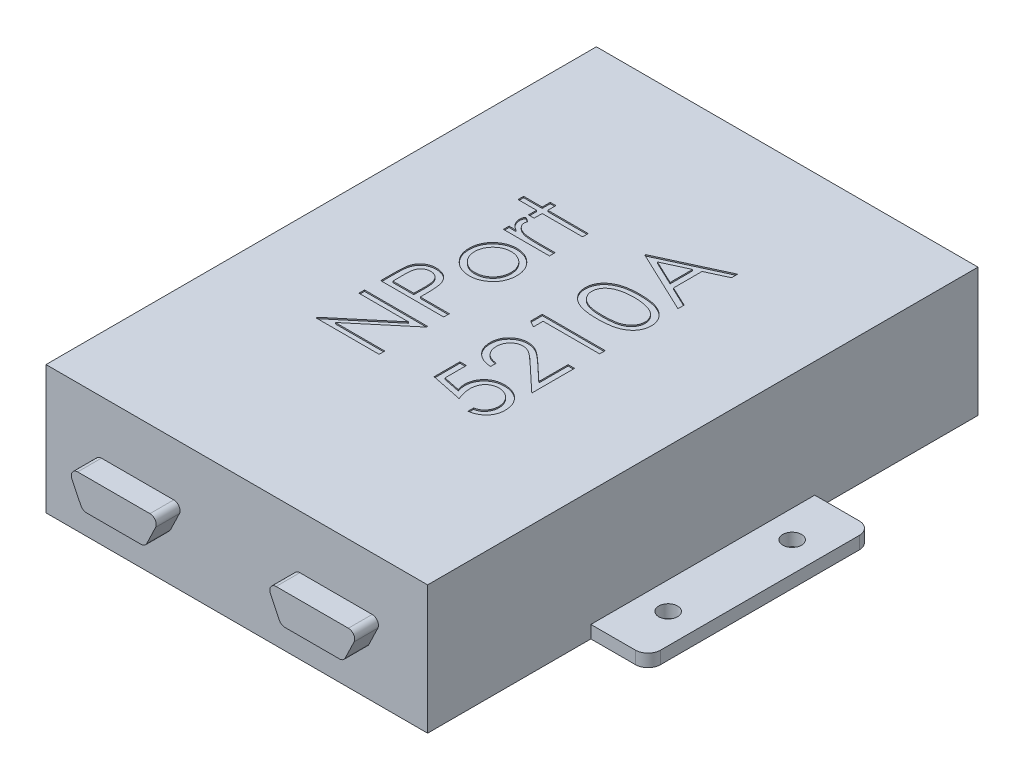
from build123d import *

# Parameters (mm, degrees)
SKETCH1_W           = 76.962
SKETCH1_H           = 110.998
BOSS_EXTRUDE1_DEPTH = 25.908
SKETCH3_R           = 1.893339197
BOSS_EXTRUDE2_DEPTH = 2.54
BOSS_EXTRUDE3_DEPTH = 4.8
SKETCH5_R           = 3.586412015
BOSS_EXTRUDE4_DEPTH = 4.8
SKETCH6_W           = 11.82831006
SKETCH6_H           = 3.119554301
CUT_EXTRUDE1_DEPTH  = 4.8
CUT_EXTRUDE2_DEPTH  = 0.254


with BuildPart() as part:
    # Sketch1 → Boss-Extrude1 (new body)
    with BuildSketch(Plane(origin=(0, 0, 0), x_dir=(1, 0, 0), z_dir=(0, 1, 0))):
        with Locations((38.481, 55.499)):
            Rectangle(SKETCH1_W, SKETCH1_H)
    extrude(amount=BOSS_EXTRUDE1_DEPTH)

    # Sketch3 → Boss-Extrude2 (add)
    # profile 1 of 2: a face of its own
    with BuildSketch(Plane(origin=(0, 0, 0), x_dir=(1, 0, 0), z_dir=(0, 1, 0))):
        with BuildLine():
            Line((0, 78.071386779), (-8.979, 78.071386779))
            ThreePointArc((-8.979, 78.071386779), (-10.775051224, 77.327438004), (-11.519, 75.531386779))
            Line((-11.519, 75.531386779), (-11.519, 35.464613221))
            ThreePointArc((-11.519, 35.464613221), (-10.775051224, 33.668561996), (-8.979, 32.924613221))
            Line((-8.979, 32.924613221), (0, 32.924613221))
            Line((0, 32.924613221), (0, 78.071386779))
        make_face()
        with Locations(Location((-5.519, 67.998, 0), (0, 0, 270))):
            Circle(SKETCH3_R, mode=Mode.SUBTRACT)
        with Locations(Location((-5.519, 42.998, 0), (0, 0, 270))):
            Circle(SKETCH3_R, mode=Mode.SUBTRACT)
    # profile 2 of 2: a face of its own
    with BuildSketch(Plane(origin=(0, 0, 0), x_dir=(1, 0, 0), z_dir=(0, 1, 0))):
        with BuildLine():
            Line((76.962, 78.071386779), (85.941, 78.071386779))
            ThreePointArc((85.941, 78.071386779), (87.737051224, 77.327438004), (88.481, 75.531386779))
            Line((88.481, 75.531386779), (88.481, 35.464613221))
            ThreePointArc((88.481, 35.464613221), (87.737051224, 33.668561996), (85.941, 32.924613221))
            Line((85.941, 32.924613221), (76.962, 32.924613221))
            Line((76.962, 32.924613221), (76.962, 78.071386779))
        make_face()
        with Locations(Location((82.481, 67.998, 0), (0, 0, 270))):
            Circle(SKETCH3_R, mode=Mode.SUBTRACT)
        with Locations(Location((82.481, 42.998, 0), (0, 0, 270))):
            Circle(SKETCH3_R, mode=Mode.SUBTRACT)
    extrude(amount=BOSS_EXTRUDE2_DEPTH)

    # Sketch4 → Boss-Extrude3 (add)
    with BuildSketch(Plane.XY):
        with BuildLine():
            Line((11.178944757, 15.150691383), (25.762179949, 15.150691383))
            ThreePointArc((25.762179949, 15.150691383), (26.837365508, 14.556617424), (26.906661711, 13.330181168))
            Line((26.906661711, 13.330181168), (25.116962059, 9.609489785))
            ThreePointArc((25.116962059, 9.609489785), (24.648406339, 9.084814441), (23.972480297, 8.89))
            Line((23.972480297, 8.89), (12.96864441, 8.89))
            ThreePointArc((12.96864441, 8.89), (12.292718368, 9.084814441), (11.824162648, 9.609489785))
            Line((11.824162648, 9.609489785), (10.034462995, 13.330181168))
            ThreePointArc((10.034462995, 13.330181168), (10.103759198, 14.556617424), (11.178944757, 15.150691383))
        make_face()
        with BuildLine():
            Line((51.199820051, 15.150691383), (65.783055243, 15.150691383))
            ThreePointArc((65.783055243, 15.150691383), (66.858240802, 14.556617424), (66.927537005, 13.330181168))
            Line((66.927537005, 13.330181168), (65.137837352, 9.609489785))
            ThreePointArc((65.137837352, 9.609489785), (64.669281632, 9.084814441), (63.99335559, 8.89))
            Line((63.99335559, 8.89), (52.989519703, 8.89))
            ThreePointArc((52.989519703, 8.89), (52.313593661, 9.084814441), (51.845037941, 9.609489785))
            Line((51.845037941, 9.609489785), (50.055338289, 13.330181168))
            ThreePointArc((50.055338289, 13.330181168), (50.124634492, 14.556617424), (51.199820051, 15.150691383))
        make_face()
    extrude(amount=BOSS_EXTRUDE3_DEPTH)

    # Sketch5 → Boss-Extrude4 (add)
    with BuildSketch(Plane(origin=(0, 0, -110.998), x_dir=(-1, 0, 0), z_dir=(0, 0, -1))):
        with Locations(Location((-11.298504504, 11.677508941, 0), (0, 0, 180))):
            Circle(SKETCH5_R)
    extrude(amount=BOSS_EXTRUDE4_DEPTH)

    # Sketch6 → Cut-Extrude1 (cut)
    with BuildSketch(Plane(origin=(0, 0, -110.998), x_dir=(-1, 0, 0), z_dir=(0, 0, -1))):
        Polygon((-50.319567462, 10.220744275), (-47.514567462, 10.220744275), (-47.514567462, 16.085189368), (-59.194567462, 16.085189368), (-59.194567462, 10.220744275), (-56.389567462, 10.220744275), (-56.389567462, 8.715008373), (-54.979567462, 8.715008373), (-54.979567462, 7.605518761), (-51.729567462, 7.605518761), (-51.729567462, 8.715008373), (-50.319567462, 8.715008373), align=None)
        with Locations((-31.396870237, 12.965635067)):
            Rectangle(SKETCH6_W, SKETCH6_H)
    extrude(amount=-CUT_EXTRUDE1_DEPTH, mode=Mode.SUBTRACT)

    # Sketch2 → Cut-Extrude2 (cut)
    # profile 1 of 10: a face of its own
    with BuildSketch(Plane(origin=(102.87, 25.908, 0), x_dir=(0, 0, -1), z_dir=(0, 1, 0))):
        Polygon((35.380851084, 71.074543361), (35.380851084, 83.774543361), (35.619993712, 83.774543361), (44.010338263, 73.778890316), (44.010338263, 83.774543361), (45.150081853, 83.774543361), (45.150081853, 71.074543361), (44.890586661, 71.074543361), (36.520594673, 81.047299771), (36.520594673, 71.074543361), align=None)
    # profile 2 of 10: a face of its own
    with BuildSketch(Plane(origin=(102.87, 25.908, 0), x_dir=(0, 0, -1), z_dir=(0, 1, 0))):
        with BuildLine():
            Line((48.406492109, 83.774543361), (50.897137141, 83.774543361))
            add(Edge.make_bspline(
                [(50.897137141, 83.774543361), (51.068445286, 83.774355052), (51.3966793, 83.773994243), (51.867359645, 83.763055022), (52.294840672, 83.748443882), (52.678200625, 83.728189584), (53.018619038, 83.704253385), (53.314555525, 83.6706817), (53.568336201, 83.635628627), (53.720396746, 83.599990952), (53.789745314, 83.583738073)],
                knots=[0, 0, 0, 0, 1.415646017, 2.712440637, 3.8905458, 4.950247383, 5.884950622, 6.709939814, 7.411656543, 8, 8, 8, 8], degree=3))
            add(Edge.make_bspline(
                [(53.789745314, 83.583738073), (53.87753328, 83.559709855), (54.051040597, 83.512219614), (54.301052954, 83.417101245), (54.538919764, 83.304317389), (54.765457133, 83.175779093), (54.977881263, 83.025971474), (55.179361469, 82.860967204), (55.368119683, 82.676956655), (55.543094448, 82.476003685), (55.703785, 82.261481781), (55.842141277, 82.030188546), (55.957991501, 81.786017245), (56.057353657, 81.529137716), (56.128867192, 81.257392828), (56.182740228, 80.972670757), (56.216934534, 80.675002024), (56.220209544, 80.471584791), (56.221876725, 80.368032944)],
                knots=[0, 0, 0, 0, 0.999701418, 1.975846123, 2.934577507, 3.890451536, 4.834027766, 5.787354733, 6.749476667, 7.726910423, 8.712836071, 9.690891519, 10.682875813, 11.679750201, 12.712814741, 13.765529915, 14.8625177, 16, 16, 16, 16], degree=3))
            add(Edge.make_bspline(
                [(56.221876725, 80.368032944), (56.220347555, 80.263610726), (56.217355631, 80.059301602), (56.181446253, 79.760406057), (56.1330767, 79.474770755), (56.058701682, 79.203029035), (55.96129024, 78.946794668), (55.847019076, 78.702151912), (55.709193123, 78.473262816), (55.550824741, 78.259296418), (55.374651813, 78.060051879), (55.181419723, 77.876973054), (54.971908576, 77.711131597), (54.74678421, 77.562155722), (54.503851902, 77.433500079), (54.246796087, 77.31826643), (53.973382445, 77.221488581), (53.784179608, 77.170579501), (53.687982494, 77.144695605)],
                knots=[0, 0, 0, 0, 1.121902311, 2.195077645, 3.232258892, 4.234102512, 5.217864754, 6.176164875, 7.132989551, 8.084763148, 9.034132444, 9.988522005, 10.94243251, 11.903244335, 12.886203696, 13.894208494, 14.929344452, 16, 16, 16, 16], degree=3))
            add(Edge.make_bspline(
                [(53.687982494, 77.144695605), (53.608417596, 77.127775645), (53.434046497, 77.090694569), (53.146871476, 77.049298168), (52.812515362, 77.013964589), (52.431434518, 76.987471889), (52.003971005, 76.964791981), (51.529893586, 76.946764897), (51.008271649, 76.936859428), (50.644430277, 76.936348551), (50.454468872, 76.936081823)],
                knots=[0, 0, 0, 0, 0.601384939, 1.31797006, 2.144135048, 3.087295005, 4.142315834, 5.309527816, 6.595305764, 8, 8, 8, 8], degree=3))
            Line((50.454468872, 76.936081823), (49.546235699, 76.936081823))
            Line((49.546235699, 76.936081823), (49.546235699, 71.074543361))
            Line((49.546235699, 71.074543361), (48.406492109, 71.074543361))
            Line((48.406492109, 71.074543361), (48.406492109, 83.774543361))
        make_face()
        with BuildLine():
            Line((49.546235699, 82.471979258), (49.546235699, 78.238645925))
            Line((49.546235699, 78.238645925), (51.769753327, 78.210661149))
            add(Edge.make_bspline(
                [(51.769753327, 78.210661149), (51.878319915, 78.210605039), (52.087905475, 78.210496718), (52.390659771, 78.224957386), (52.671544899, 78.241650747), (52.929698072, 78.266092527), (53.165235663, 78.30064109), (53.378550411, 78.335517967), (53.567988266, 78.385974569), (53.789691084, 78.453912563), (54.036736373, 78.569782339), (54.305495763, 78.737966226), (54.53326332, 78.952344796), (54.730361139, 79.193382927), (54.886773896, 79.461531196), (55.001277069, 79.748438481), (55.068554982, 80.051162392), (55.077576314, 80.258310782), (55.082133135, 80.362944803)],
                knots=[0, 0, 0, 0, 1.160613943, 2.240541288, 3.23993089, 4.169200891, 5.011653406, 5.7853311, 6.478053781, 7.106038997, 8.262395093, 9.384106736, 10.481365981, 11.59014053, 12.70357646, 13.786202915, 14.881775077, 16, 16, 16, 16], degree=3))
            add(Edge.make_bspline(
                [(55.082133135, 80.362944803), (55.077551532, 80.465047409), (55.068443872, 80.668014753), (55.00074974, 80.965480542), (54.886996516, 81.249364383), (54.729311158, 81.514152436), (54.537936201, 81.754323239), (54.315507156, 81.962955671), (54.062547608, 82.130674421), (53.827241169, 82.238926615), (53.618231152, 82.305022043), (53.436686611, 82.351267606), (53.231706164, 82.388190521), (53.003223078, 82.418088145), (52.753008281, 82.443682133), (52.47891211, 82.461048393), (52.18197289, 82.471213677), (51.975831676, 82.471717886), (51.868972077, 82.471979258)],
                knots=[0, 0, 0, 0, 1.120700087, 2.227813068, 3.331159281, 4.466773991, 5.599788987, 6.693661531, 7.80175334, 8.91857717, 9.525282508, 10.207424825, 10.974604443, 11.810962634, 12.737642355, 13.736264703, 14.826523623, 16, 16, 16, 16], degree=3))
            Line((51.868972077, 82.471979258), (49.546235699, 82.471979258))
        make_face(mode=Mode.SUBTRACT)
    # profile 3 of 10: a face of its own
    with BuildSketch(Plane(origin=(102.87, 25.908, 0), x_dir=(0, 0, -1), z_dir=(0, 1, 0))):
        with BuildLine():
            add(Edge.make_bspline(
                [(62.984016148, 80.518133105), (63.158155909, 80.5144251), (63.499601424, 80.507154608), (63.999647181, 80.429448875), (64.476968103, 80.310622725), (64.933392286, 80.146351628), (65.363074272, 79.926162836), (65.772272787, 79.663420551), (66.159865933, 79.352152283), (66.392178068, 79.111367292), (66.510097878, 78.989146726)],
                knots=[0, 0, 0, 0, 1.054011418, 2.066658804, 3.057071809, 4.030435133, 4.997543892, 5.974964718, 6.972108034, 8, 8, 8, 8], degree=3))
            add(Edge.make_bspline(
                [(66.510097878, 78.989146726), (66.611632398, 78.872255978), (66.812736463, 78.640736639), (67.0706035, 78.265340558), (67.292750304, 77.87657505), (67.470778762, 77.469277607), (67.611150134, 77.047003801), (67.710811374, 76.608302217), (67.77009111, 76.1541417), (67.778084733, 75.845699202), (67.782133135, 75.689487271)],
                knots=[0, 0, 0, 0, 1.025258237, 2.030674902, 3.01204498, 3.988269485, 4.97094183, 5.956517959, 6.965070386, 8, 8, 8, 8], degree=3))
            add(Edge.make_bspline(
                [(67.782133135, 75.689487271), (67.778572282, 75.532369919), (67.771535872, 75.221898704), (67.704974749, 74.764628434), (67.601447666, 74.321235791), (67.453286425, 73.893577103), (67.263301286, 73.480345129), (67.031469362, 73.083344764), (66.75616378, 72.701792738), (66.444092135, 72.338928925), (66.099189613, 72.004497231), (65.725025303, 71.713020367), (65.328952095, 71.46329655), (64.905703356, 71.262141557), (64.459144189, 71.103537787), (63.988311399, 70.992140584), (63.49393643, 70.924788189), (63.156380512, 70.916139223), (62.984016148, 70.911722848)],
                knots=[0, 0, 0, 0, 0.998656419, 1.973391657, 2.932242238, 3.890759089, 4.846373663, 5.82037756, 6.809684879, 7.83454468, 8.860553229, 9.859544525, 10.845671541, 11.83227036, 12.833544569, 13.85385346, 14.904124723, 16, 16, 16, 16], degree=3))
            add(Edge.make_bspline(
                [(62.984016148, 70.911722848), (62.810807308, 70.916154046), (62.471569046, 70.92483277), (61.975449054, 70.991878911), (61.503772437, 71.103486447), (61.056628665, 71.262662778), (60.631560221, 71.46330298), (60.233192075, 71.712265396), (59.85872381, 72.004583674), (59.513748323, 72.338905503), (59.201696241, 72.701798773), (58.926385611, 73.083343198), (58.694554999, 73.480345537), (58.504569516, 73.893576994), (58.356408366, 74.321235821), (58.252881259, 74.764628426), (58.186320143, 75.221898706), (58.179283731, 75.53236992), (58.175722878, 75.689487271)],
                knots=[0, 0, 0, 0, 1.099876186, 2.154163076, 3.173186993, 4.173200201, 5.163417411, 6.152872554, 7.150605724, 8.17532212, 9.198891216, 10.186952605, 11.159729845, 12.11414092, 13.071450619, 14.029093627, 15.002601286, 16, 16, 16, 16], degree=3))
            add(Edge.make_bspline(
                [(58.175722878, 75.689487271), (58.17979889, 75.844850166), (58.187868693, 76.152441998), (58.247088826, 76.605748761), (58.346361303, 77.043707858), (58.486900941, 77.464351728), (58.666570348, 77.869864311), (58.885595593, 78.259590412), (59.146093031, 78.633289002), (59.346397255, 78.864509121), (59.447758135, 78.981514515)],
                knots=[0, 0, 0, 0, 1.031353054, 2.041901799, 3.029428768, 4.008703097, 4.981709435, 5.96992636, 6.972712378, 8, 8, 8, 8], degree=3))
            add(Edge.make_bspline(
                [(59.447758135, 78.981514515), (59.565500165, 79.104795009), (59.797060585, 79.347247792), (60.186583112, 79.657608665), (60.594774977, 79.925818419), (61.029205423, 80.141632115), (61.485254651, 80.311589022), (61.965021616, 80.42975532), (62.466764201, 80.506874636), (62.80988054, 80.514342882), (62.984016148, 80.518133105)],
                knots=[0, 0, 0, 0, 1.027980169, 2.021703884, 2.998553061, 3.971491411, 4.943284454, 5.930300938, 6.949603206, 8, 8, 8, 8], degree=3))
        make_face()
        with BuildLine():
            add(Edge.make_bspline(
                [(62.978928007, 79.378389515), (62.85578296, 79.374889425), (62.612671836, 79.3679796), (62.254823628, 79.315423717), (61.910326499, 79.232157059), (61.578526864, 79.113850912), (61.260543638, 78.961092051), (60.956072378, 78.773464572), (60.664217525, 78.553453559), (60.390688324, 78.301403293), (60.139655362, 78.026070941), (59.920206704, 77.732706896), (59.733607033, 77.426069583), (59.578158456, 77.105840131), (59.462380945, 76.768773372), (59.378295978, 76.41868651), (59.325789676, 76.054866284), (59.318944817, 75.807539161), (59.315466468, 75.68185506)],
                knots=[0, 0, 0, 0, 1.021534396, 2.016698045, 2.994645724, 3.958388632, 4.93408049, 5.916473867, 6.921342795, 7.962252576, 8.998418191, 10.008913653, 10.997312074, 11.973003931, 12.956656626, 13.948281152, 14.957379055, 16, 16, 16, 16], degree=3))
            add(Edge.make_bspline(
                [(59.315466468, 75.68185506), (59.321296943, 75.519469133), (59.332869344, 75.197163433), (59.426977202, 74.72250593), (59.584407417, 74.26682321), (59.796995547, 73.832786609), (60.063355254, 73.431204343), (60.377179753, 73.073167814), (60.735100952, 72.764065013), (61.132852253, 72.507594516), (61.562309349, 72.303814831), (62.016810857, 72.159401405), (62.490849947, 72.065524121), (62.814811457, 72.056193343), (62.978928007, 72.051466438)],
                knots=[0, 0, 0, 0, 1.016792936, 2.018143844, 3.017858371, 4.030088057, 5.03801393, 6.028138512, 7.003788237, 7.991172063, 8.984598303, 9.972568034, 10.972917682, 12, 12, 12, 12], degree=3))
            add(Edge.make_bspline(
                [(62.978928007, 72.051466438), (63.143035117, 72.056220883), (63.466977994, 72.065606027), (63.940358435, 72.158928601), (64.393617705, 72.304447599), (64.822628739, 72.507365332), (65.220198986, 72.765038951), (65.580694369, 73.071422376), (65.89183933, 73.432152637), (66.157935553, 73.833318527), (66.374005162, 74.266150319), (66.530698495, 74.722590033), (66.625032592, 75.197142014), (66.636574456, 75.519461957), (66.642389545, 75.68185506)],
                knots=[0, 0, 0, 0, 1.02726834, 2.027799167, 3.010890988, 4.004497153, 4.992059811, 5.971914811, 6.958719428, 7.966827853, 8.981595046, 9.981490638, 10.983022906, 12, 12, 12, 12], degree=3))
            add(Edge.make_bspline(
                [(66.642389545, 75.68185506), (66.638912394, 75.807539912), (66.632069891, 76.054868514), (66.579546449, 76.418677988), (66.495524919, 76.768804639), (66.379513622, 77.105724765), (66.224740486, 77.426898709), (66.034542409, 77.731806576), (65.815989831, 78.027087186), (65.561927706, 78.300513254), (65.288684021, 78.553551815), (64.996710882, 78.773549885), (64.692691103, 78.960267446), (64.375631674, 79.115157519), (64.0437895, 79.231080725), (63.69977506, 79.315904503), (63.343453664, 79.367757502), (63.101213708, 79.374822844), (62.978928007, 79.378389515)],
                knots=[0, 0, 0, 0, 1.042956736, 2.052379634, 3.044323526, 4.02829302, 5.004299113, 5.996692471, 7.007513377, 8.048758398, 9.090003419, 10.095195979, 11.07790575, 12.047570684, 13.018257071, 13.989683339, 14.985167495, 16, 16, 16, 16], degree=3))
        make_face(mode=Mode.SUBTRACT)
    # profile 4 of 10: a face of its own
    with BuildSketch(Plane(origin=(102.87, 25.908, 0), x_dir=(0, 0, -1), z_dir=(0, 1, 0))):
        with BuildLine():
            Line((69.735979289, 80.355312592), (70.875722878, 80.355312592))
            Line((70.875722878, 80.355312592), (70.875722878, 78.989146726))
            add(Edge.make_bspline(
                [(70.875722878, 78.989146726), (70.959864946, 79.116349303), (71.120785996, 79.359623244), (71.388258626, 79.681366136), (71.662227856, 79.947757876), (71.94400525, 80.160042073), (72.235662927, 80.319021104), (72.530799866, 80.435472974), (72.834059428, 80.504333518), (73.037846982, 80.513527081), (73.139945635, 80.518133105)],
                knots=[0, 0, 0, 0, 1.2804753, 2.448899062, 3.506932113, 4.484331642, 5.4025378, 6.288909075, 7.142734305, 8, 8, 8, 8], degree=3))
            add(Edge.make_bspline(
                [(73.139945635, 80.518133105), (73.21914402, 80.513813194), (73.382099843, 80.504924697), (73.628779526, 80.44247399), (73.882937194, 80.342768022), (74.046739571, 80.249004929), (74.132133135, 80.20012429)],
                knots=[0, 0, 0, 0, 0.901110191, 1.854092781, 2.881294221, 4, 4, 4, 4], degree=3))
            Line((74.132133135, 80.20012429), (73.506291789, 79.213024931))
            add(Edge.make_bspline(
                [(73.506291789, 79.213024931), (73.451467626, 79.237482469), (73.347400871, 79.283907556), (73.19516573, 79.338851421), (73.054807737, 79.371203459), (72.965386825, 79.376104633), (72.923699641, 79.378389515)],
                knots=[0, 0, 0, 0, 1.180555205, 2.24091978, 3.179933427, 4, 4, 4, 4], degree=3))
            add(Edge.make_bspline(
                [(72.923699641, 79.378389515), (72.832238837, 79.372293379), (72.645685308, 79.35985903), (72.37178441, 79.262109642), (72.106001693, 79.104175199), (71.894921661, 78.929020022), (71.731482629, 78.760118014), (71.614859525, 78.612622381), (71.507879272, 78.447237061), (71.405661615, 78.266789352), (71.312529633, 78.068198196), (71.225608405, 77.853447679), (71.147017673, 77.622289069), (71.10220393, 77.461243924), (71.079248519, 77.378750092)],
                knots=[0, 0, 0, 0, 1.125678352, 2.296057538, 3.5422874, 4.923748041, 5.663163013, 6.437101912, 7.23742474, 8.08941207, 8.991984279, 9.93940061, 10.944477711, 12, 12, 12, 12], degree=3))
            add(Edge.make_bspline(
                [(71.079248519, 77.378750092), (71.062076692, 77.305172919), (71.024042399, 77.142205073), (70.987061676, 76.868797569), (70.950523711, 76.545768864), (70.924773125, 76.172219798), (70.900904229, 75.749083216), (70.88744193, 75.275714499), (70.876181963, 74.751627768), (70.875880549, 74.385235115), (70.875722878, 74.19357381)],
                knots=[0, 0, 0, 0, 0.566838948, 1.255505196, 2.06880316, 3.007127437, 4.065329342, 5.249902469, 6.561414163, 8, 8, 8, 8], degree=3))
            Line((70.875722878, 74.19357381), (70.875722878, 71.074543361))
            Line((70.875722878, 71.074543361), (69.735979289, 71.074543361))
            Line((69.735979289, 71.074543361), (69.735979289, 80.355312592))
        make_face()
    # profile 5 of 10: a face of its own
    with BuildSketch(Plane(origin=(102.87, 25.908, 0), x_dir=(0, 0, -1), z_dir=(0, 1, 0))):
        Polygon((76.411620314, 84.100184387), (77.551363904, 84.100184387), (77.551363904, 80.355312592), (79.179569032, 80.355312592), (79.179569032, 79.215569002), (77.551363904, 79.215569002), (77.551363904, 71.074543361), (76.411620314, 71.074543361), (76.411620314, 79.215569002), (74.783415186, 79.215569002), (74.783415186, 80.355312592), (76.411620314, 80.355312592), align=None)
    # profile 6 of 10: a face of its own
    with BuildSketch(Plane(origin=(102.87, 25.908, 0), x_dir=(0, 0, -1), z_dir=(0, 1, 0))):
        with BuildLine():
            Line((42.219312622, 61.607876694), (42.219312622, 60.305312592))
            Line((42.219312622, 60.305312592), (37.902024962, 60.305312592))
            Line((37.902024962, 60.305312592), (37.215125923, 56.964948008))
            add(Edge.make_bspline(
                [(37.215125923, 56.964948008), (37.34958581, 57.00206928), (37.610080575, 57.073985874), (37.994563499, 57.153835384), (38.359569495, 57.201969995), (38.596425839, 57.208542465), (38.711039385, 57.211722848)],
                knots=[0, 0, 0, 0, 1.100273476, 2.13160584, 3.095893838, 4, 4, 4, 4], degree=3))
            add(Edge.make_bspline(
                [(38.711039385, 57.211722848), (38.852857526, 57.20865331), (39.131707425, 57.202617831), (39.539700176, 57.144662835), (39.929165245, 57.053440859), (40.299288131, 56.926003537), (40.650753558, 56.763045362), (40.980327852, 56.559482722), (41.292957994, 56.321690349), (41.583035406, 56.048295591), (41.846195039, 55.747408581), (42.077574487, 55.423892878), (42.274107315, 55.080892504), (42.432170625, 54.715130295), (42.558388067, 54.330649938), (42.642396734, 53.923405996), (42.698337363, 53.497237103), (42.704587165, 53.205846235), (42.707774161, 53.057255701)],
                knots=[0, 0, 0, 0, 1.052922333, 2.070308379, 3.05430497, 4.020497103, 4.973039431, 5.925935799, 6.892292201, 7.88610001, 8.88166317, 9.857072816, 10.836096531, 11.812156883, 12.81219415, 13.836441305, 14.89672472, 16, 16, 16, 16], degree=3))
            add(Edge.make_bspline(
                [(42.707774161, 53.057255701), (42.705360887, 52.953760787), (42.700566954, 52.748169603), (42.676188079, 52.442846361), (42.62924991, 52.143986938), (42.566229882, 51.851551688), (42.484433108, 51.566094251), (42.385412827, 51.286797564), (42.264232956, 51.015399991), (42.131313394, 50.749333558), (41.981647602, 50.49461326), (41.815537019, 50.256401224), (41.640039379, 50.031123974), (41.451203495, 49.821197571), (41.24727417, 49.628001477), (41.030721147, 49.450389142), (40.803272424, 49.285356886), (40.561409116, 49.139603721), (40.310520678, 49.005480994), (40.046984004, 48.895449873), (39.776798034, 48.797077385), (39.496074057, 48.718665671), (39.205447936, 48.657224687), (38.904440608, 48.615493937), (38.594630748, 48.585099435), (38.384627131, 48.583196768), (38.278547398, 48.582235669)],
                knots=[0, 0, 0, 0, 1.056347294, 2.098418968, 3.122841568, 4.141288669, 5.149314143, 6.15115421, 7.162517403, 8.180376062, 9.185164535, 10.17417709, 11.141909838, 12.097768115, 13.052685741, 14.0056014, 14.954263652, 15.917497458, 16.885230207, 17.854509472, 18.828990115, 19.81800267, 20.826176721, 21.857883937, 22.917946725, 24, 24, 24, 24], degree=3))
            add(Edge.make_bspline(
                [(38.278547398, 48.582235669), (38.152003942, 48.584742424), (37.903044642, 48.589674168), (37.538298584, 48.641266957), (37.187362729, 48.715158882), (36.853062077, 48.826324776), (36.532400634, 48.965615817), (36.229695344, 49.14166021), (35.937211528, 49.341155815), (35.66683928, 49.57657881), (35.415901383, 49.833901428), (35.191269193, 50.113147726), (34.991213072, 50.409708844), (34.818936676, 50.725025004), (34.671986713, 51.058267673), (34.556543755, 51.410685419), (34.46336801, 51.780436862), (34.423949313, 52.034993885), (34.403928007, 52.164286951)],
                knots=[0, 0, 0, 0, 1.0467383, 2.05933395, 3.04377827, 4.011590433, 4.970194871, 5.932262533, 6.905835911, 7.896367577, 8.894135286, 9.877477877, 10.858688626, 11.851381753, 12.8477658, 13.868841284, 14.917554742, 16, 16, 16, 16], degree=3))
            Line((34.403928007, 52.164286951), (35.543671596, 52.164286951))
            add(Edge.make_bspline(
                [(35.543671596, 52.164286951), (35.571715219, 52.043178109), (35.625616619, 51.81040019), (35.743928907, 51.48335218), (35.888585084, 51.19190814), (36.060595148, 50.932212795), (36.265790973, 50.705757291), (36.499940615, 50.503946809), (36.762459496, 50.321882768), (37.054172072, 50.17012587), (37.361922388, 50.040699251), (37.68402055, 49.954514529), (38.011696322, 49.893914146), (38.233323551, 49.887848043), (38.344693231, 49.884799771)],
                knots=[0, 0, 0, 0, 1.136247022, 2.183929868, 3.172523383, 4.106158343, 5.02341133, 5.958108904, 6.928429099, 7.938127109, 8.96079061, 9.975095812, 10.982467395, 12, 12, 12, 12], degree=3))
            add(Edge.make_bspline(
                [(38.344693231, 49.884799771), (38.453399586, 49.887778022), (38.66744329, 49.893642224), (38.982444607, 49.938778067), (39.286565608, 50.008292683), (39.576805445, 50.1123233), (39.858243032, 50.23875985), (40.123759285, 50.401011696), (40.381035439, 50.587738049), (40.622074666, 50.801666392), (40.842834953, 51.03741357), (41.037892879, 51.289517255), (41.200369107, 51.558455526), (41.337290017, 51.839572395), (41.441260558, 52.135948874), (41.515432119, 52.446195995), (41.558986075, 52.771080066), (41.564977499, 52.992674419), (41.568030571, 53.10559304)],
                knots=[0, 0, 0, 0, 1.027316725, 2.022795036, 3.002884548, 3.971462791, 4.93288096, 5.914575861, 6.907176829, 7.935150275, 8.956128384, 9.956726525, 10.942570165, 11.921478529, 12.907843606, 13.90538589, 14.932640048, 16, 16, 16, 16], degree=3))
            add(Edge.make_bspline(
                [(41.568030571, 53.10559304), (41.565641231, 53.207467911), (41.560964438, 53.406873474), (41.522753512, 53.698607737), (41.456289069, 53.974644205), (41.364036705, 54.236315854), (41.246908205, 54.483869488), (41.103774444, 54.717560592), (40.931949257, 54.934309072), (40.735672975, 55.134216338), (40.520650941, 55.318710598), (40.283183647, 55.475987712), (40.028240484, 55.608299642), (39.75889308, 55.722483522), (39.468734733, 55.804491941), (39.163511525, 55.866061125), (38.83992747, 55.90167687), (38.618690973, 55.906618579), (38.504969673, 55.909158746)],
                knots=[0, 0, 0, 0, 1.045622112, 2.046656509, 3.013763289, 3.955457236, 4.890082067, 5.820317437, 6.762574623, 7.722996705, 8.69280354, 9.665887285, 10.63943826, 11.638615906, 12.663482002, 13.728887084, 14.832589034, 16, 16, 16, 16], degree=3))
            add(Edge.make_bspline(
                [(38.504969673, 55.909158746), (38.406530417, 55.907052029), (38.203278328, 55.902702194), (37.891501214, 55.87067462), (37.563871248, 55.819006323), (37.221644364, 55.747936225), (36.863792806, 55.654932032), (36.491071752, 55.543482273), (36.102697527, 55.410233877), (35.841013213, 55.309605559), (35.706492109, 55.257876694)],
                knots=[0, 0, 0, 0, 0.817624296, 1.688186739, 2.600797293, 3.572016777, 4.590301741, 5.671205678, 6.80286297, 8, 8, 8, 8], degree=3))
            Line((35.706492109, 55.257876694), (37.009056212, 61.607876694))
            Line((37.009056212, 61.607876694), (42.219312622, 61.607876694))
        make_face()
    # profile 7 of 10: a face of its own
    with BuildSketch(Plane(origin=(102.87, 25.908, 0), x_dir=(0, 0, -1), z_dir=(0, 1, 0))):
        with BuildLine():
            Line((45.638543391, 57.700184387), (44.498799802, 57.700184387))
            add(Edge.make_bspline(
                [(44.498799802, 57.700184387), (44.506228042, 57.851390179), (44.52081691, 58.148354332), (44.589136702, 58.58132965), (44.6868936, 58.995185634), (44.825111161, 59.386599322), (44.996765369, 59.759031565), (45.202614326, 60.11100305), (45.446432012, 60.441171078), (45.72295359, 60.746474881), (46.023285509, 61.026555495), (46.347338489, 61.268418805), (46.687861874, 61.472771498), (47.04382255, 61.643609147), (47.419236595, 61.771842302), (47.81069725, 61.866989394), (48.219924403, 61.924234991), (48.498743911, 61.930388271), (48.640546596, 61.93351772)],
                knots=[0, 0, 0, 0, 1.10065271, 2.161652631, 3.183658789, 4.190468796, 5.17591951, 6.163126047, 7.15150782, 8.156236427, 9.156009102, 10.134482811, 11.092018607, 12.041330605, 13.001268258, 13.972401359, 14.968799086, 16, 16, 16, 16], degree=3))
            add(Edge.make_bspline(
                [(48.640546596, 61.93351772), (48.77980418, 61.930257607), (49.053440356, 61.9238516), (49.452808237, 61.868838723), (49.833000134, 61.782676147), (50.193272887, 61.661788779), (50.530752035, 61.499285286), (50.847972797, 61.304077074), (51.148711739, 61.078307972), (51.419427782, 60.812501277), (51.668014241, 60.528738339), (51.882470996, 60.225796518), (52.066124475, 59.912907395), (52.219205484, 59.587685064), (52.331894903, 59.247067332), (52.417450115, 58.896013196), (52.465809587, 58.530888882), (52.473231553, 58.28375938), (52.47700493, 58.158117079)],
                knots=[0, 0, 0, 0, 1.111607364, 2.184268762, 3.212621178, 4.221274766, 5.211760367, 6.196651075, 7.1921475, 8.207485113, 9.220403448, 10.201281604, 11.166441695, 12.114753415, 13.065576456, 14.026450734, 14.996634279, 16, 16, 16, 16], degree=3))
            add(Edge.make_bspline(
                [(52.47700493, 58.158117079), (52.470884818, 57.981224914), (52.458751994, 57.630544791), (52.354047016, 57.114546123), (52.192277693, 56.614147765), (51.996069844, 56.211452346), (51.797875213, 55.888593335), (51.623051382, 55.620385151), (51.413855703, 55.334357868), (51.172202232, 55.027630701), (50.901736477, 54.699265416), (50.600511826, 54.349127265), (50.266227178, 53.980935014), (50.031610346, 53.729453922), (49.910037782, 53.59914272)],
                knots=[0, 0, 0, 0, 1.184203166, 2.347625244, 3.513805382, 4.700623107, 5.337941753, 6.051866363, 6.845199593, 7.711357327, 8.668078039, 9.695487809, 10.805859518, 12, 12, 12, 12], degree=3))
            Line((49.910037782, 53.59914272), (46.732493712, 50.210440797))
            Line((46.732493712, 50.210440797), (52.639825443, 50.210440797))
            Line((52.639825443, 50.210440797), (52.639825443, 48.907876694))
            Line((52.639825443, 48.907876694), (44.010338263, 48.907876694))
            Line((44.010338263, 48.907876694), (48.935658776, 54.163926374))
            add(Edge.make_bspline(
                [(48.935658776, 54.163926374), (49.055575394, 54.289105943), (49.285910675, 54.529550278), (49.611693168, 54.880589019), (49.904297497, 55.206251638), (50.165617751, 55.505922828), (50.389985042, 55.783985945), (50.589092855, 56.031435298), (50.748625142, 56.259144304), (50.921763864, 56.523088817), (51.089454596, 56.845350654), (51.233553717, 57.239172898), (51.321419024, 57.644583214), (51.331959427, 57.918547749), (51.33726134, 58.056354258)],
                knots=[0, 0, 0, 0, 1.329631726, 2.553950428, 3.673215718, 4.687767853, 5.603093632, 6.413772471, 7.123043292, 7.734684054, 8.834405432, 9.900288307, 10.943827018, 12, 12, 12, 12], degree=3))
            add(Edge.make_bspline(
                [(51.33726134, 58.056354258), (51.334954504, 58.143009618), (51.330408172, 58.313790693), (51.290284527, 58.564183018), (51.229649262, 58.8057182), (51.142762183, 59.039139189), (51.028074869, 59.262099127), (50.888471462, 59.474869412), (50.727398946, 59.680569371), (50.541067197, 59.87343991), (50.336373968, 60.050083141), (50.120131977, 60.206561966), (49.89135017, 60.337332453), (49.650993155, 60.444533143), (49.399731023, 60.528626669), (49.137077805, 60.586896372), (48.863759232, 60.623481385), (48.677129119, 60.62843138), (48.582032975, 60.630953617)],
                knots=[0, 0, 0, 0, 0.991446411, 1.95395049, 2.89581595, 3.838931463, 4.798493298, 5.75982156, 6.748411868, 7.785213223, 8.824556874, 9.840280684, 10.836137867, 11.835679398, 12.848801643, 13.863922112, 14.911575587, 16, 16, 16, 16], degree=3))
            add(Edge.make_bspline(
                [(48.582032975, 60.630953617), (48.482715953, 60.628359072), (48.287673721, 60.623263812), (48.001310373, 60.587621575), (47.728130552, 60.526132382), (47.467447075, 60.442034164), (47.218818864, 60.335141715), (46.983455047, 60.202003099), (46.761883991, 60.043131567), (46.553689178, 59.863007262), (46.361868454, 59.662464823), (46.193332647, 59.438908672), (46.046070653, 59.196420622), (45.91758572, 58.935654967), (45.813243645, 58.654245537), (45.733512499, 58.353191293), (45.670423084, 58.033799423), (45.649346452, 57.813236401), (45.638543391, 57.700184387)],
                knots=[0, 0, 0, 0, 1.031018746, 2.02475058, 2.990194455, 3.934040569, 4.864654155, 5.795059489, 6.735614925, 7.690564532, 8.649604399, 9.611025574, 10.590972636, 11.591080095, 12.624614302, 13.701020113, 14.821632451, 16, 16, 16, 16], degree=3))
        make_face()
    # profile 8 of 10: a face of its own
    with BuildSketch(Plane(origin=(102.87, 25.908, 0), x_dir=(0, 0, -1), z_dir=(0, 1, 0))):
        Polygon((56.478827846, 61.607876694), (58.82700493, 61.607876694), (58.82700493, 48.907876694), (57.68726134, 48.907876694), (57.68726134, 60.305312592), (55.733415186, 60.305312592), align=None)
    # profile 9 of 10: a face of its own
    with BuildSketch(Plane(origin=(102.87, 25.908, 0), x_dir=(0, 0, -1), z_dir=(0, 1, 0))):
        with BuildLine():
            add(Edge.make_bspline(
                [(63.548799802, 55.252788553), (63.549990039, 55.456341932), (63.552302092, 55.851747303), (63.578022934, 56.427908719), (63.620750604, 56.968421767), (63.679306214, 57.473312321), (63.750564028, 57.942710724), (63.845688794, 58.375362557), (63.953866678, 58.773270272), (64.079242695, 59.13773142), (64.220712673, 59.473656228), (64.374688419, 59.787256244), (64.547280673, 60.07805697), (64.728625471, 60.350699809), (64.92606356, 60.600721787), (65.133976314, 60.831653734), (65.36047855, 61.038158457), (65.597870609, 61.226286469), (65.84830178, 61.391203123), (66.10463374, 61.536464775), (66.368630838, 61.660561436), (66.641013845, 61.758135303), (66.919334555, 61.838728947), (67.204565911, 61.893843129), (67.49717886, 61.928521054), (67.694687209, 61.931836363), (67.794853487, 61.93351772)],
                knots=[0, 0, 0, 0, 1.646270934, 3.197905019, 4.663502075, 6.030701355, 7.308322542, 8.50163776, 9.611534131, 10.641858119, 11.616356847, 12.558055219, 13.465016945, 14.349605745, 15.204443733, 16.039544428, 16.859896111, 17.680448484, 18.487036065, 19.28249412, 20.06191084, 20.843045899, 21.620316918, 22.403196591, 23.190181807, 24, 24, 24, 24], degree=3))
            add(Edge.make_bspline(
                [(67.794853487, 61.93351772), (67.895856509, 61.931747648), (68.096719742, 61.928227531), (68.393683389, 61.89439494), (68.68378652, 61.838256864), (68.965792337, 61.758715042), (69.242017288, 61.660033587), (69.510300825, 61.536346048), (69.772309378, 61.392368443), (70.023879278, 61.223190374), (70.267772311, 61.034568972), (70.497997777, 60.821344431), (70.714576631, 60.585669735), (70.920227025, 60.330066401), (71.109114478, 60.04963195), (71.288995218, 59.749243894), (71.450002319, 59.423649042), (71.605068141, 59.078279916), (71.738915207, 58.703580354), (71.859624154, 58.301662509), (71.957156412, 57.867779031), (72.038397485, 57.404206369), (72.101334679, 56.909242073), (72.147173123, 56.383947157), (72.171386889, 55.827976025), (72.175946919, 55.447854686), (72.178286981, 55.252788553)],
                knots=[0, 0, 0, 0, 0.810914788, 1.612654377, 2.396697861, 3.181598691, 3.963628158, 4.749916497, 5.551656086, 6.361998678, 7.18212741, 8.025565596, 8.878627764, 9.750805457, 10.657531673, 11.591944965, 12.560506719, 13.57287815, 14.630710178, 15.753379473, 16.941251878, 18.199788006, 19.531962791, 20.947069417, 22.433333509, 24, 24, 24, 24], degree=3))
            add(Edge.make_bspline(
                [(72.178286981, 55.252788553), (72.17592266, 55.05857323), (72.171315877, 54.680152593), (72.147444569, 54.126683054), (72.100423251, 53.604175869), (72.04160415, 53.111377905), (71.960139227, 52.650340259), (71.85997191, 52.219467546), (71.748755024, 51.816899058), (71.611468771, 51.445932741), (71.461207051, 51.101393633), (71.297721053, 50.779658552), (71.122570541, 50.477883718), (70.931748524, 50.198484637), (70.72835471, 49.939482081), (70.508035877, 49.70544785), (70.277002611, 49.49074284), (70.032391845, 49.299692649), (69.776898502, 49.132470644), (69.515789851, 48.982923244), (69.244433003, 48.862336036), (68.968977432, 48.758794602), (68.685483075, 48.679690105), (68.394303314, 48.624993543), (68.096919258, 48.586632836), (67.895890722, 48.583706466), (67.794853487, 48.582235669)],
                knots=[0, 0, 0, 0, 1.561518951, 3.042555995, 4.452378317, 5.7783523, 7.031515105, 8.214008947, 9.334062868, 10.386615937, 11.391082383, 12.354592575, 13.286541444, 14.194233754, 15.072674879, 15.931287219, 16.775624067, 17.606195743, 18.42308326, 19.229000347, 20.022332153, 20.807536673, 21.593273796, 22.3848459, 23.188221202, 24, 24, 24, 24], degree=3))
            add(Edge.make_bspline(
                [(67.794853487, 48.582235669), (67.694689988, 48.583927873), (67.497187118, 48.587264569), (67.204534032, 48.621785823), (66.920480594, 48.677286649), (66.643625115, 48.754998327), (66.372547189, 48.850120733), (66.110940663, 48.974049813), (65.855896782, 49.116776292), (65.608095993, 49.279319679), (65.372194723, 49.465544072), (65.146865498, 49.671517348), (64.937769, 49.90237944), (64.743153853, 50.154485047), (64.558190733, 50.425514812), (64.388049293, 50.719169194), (64.230675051, 51.034283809), (64.086825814, 51.372894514), (63.959286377, 51.739942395), (63.846627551, 52.139626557), (63.757676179, 52.575474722), (63.681538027, 53.043986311), (63.620126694, 53.547174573), (63.578201, 54.085312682), (63.552288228, 54.658065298), (63.54998383, 55.050929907), (63.548799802, 55.252788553)],
                knots=[0, 0, 0, 0, 0.810891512, 1.598919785, 2.382837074, 3.152667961, 3.926044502, 4.706494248, 5.493654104, 6.291793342, 7.103789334, 7.925228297, 8.761435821, 9.622817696, 10.50288917, 11.416980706, 12.369136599, 13.353924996, 14.394355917, 15.514179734, 16.714354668, 17.994756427, 19.357759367, 20.818452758, 22.365282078, 24, 24, 24, 24], degree=3))
        make_face()
        with BuildLine():
            add(Edge.make_bspline(
                [(64.688543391, 55.257876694), (64.688976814, 55.088245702), (64.689818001, 54.759025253), (64.711793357, 54.280622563), (64.741729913, 53.834415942), (64.78034262, 53.419838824), (64.837684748, 53.038294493), (64.901935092, 52.687158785), (64.980123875, 52.368289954), (65.072634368, 52.079499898), (65.178004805, 51.815887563), (65.293051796, 51.570591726), (65.416643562, 51.340714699), (65.554961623, 51.12832132), (65.705601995, 50.932718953), (65.865162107, 50.750445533), (66.039596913, 50.587896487), (66.280910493, 50.392944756), (66.599486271, 50.191489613), (67.000880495, 50.016062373), (67.413334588, 49.90581746), (67.69328341, 49.891797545), (67.833014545, 49.884799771)],
                knots=[0, 0, 0, 0, 1.459021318, 2.831673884, 4.118529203, 5.306027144, 6.411944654, 7.436330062, 8.375795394, 9.233974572, 10.042671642, 10.816086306, 11.563610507, 12.285937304, 12.993564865, 13.685989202, 14.367179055, 15.041617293, 16.353048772, 17.594441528, 18.799311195, 20, 20, 20, 20], degree=3))
            add(Edge.make_bspline(
                [(67.833014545, 49.884799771), (67.973649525, 49.890597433), (68.254629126, 49.902180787), (68.665143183, 50.013936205), (69.063670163, 50.182554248), (69.375988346, 50.381935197), (69.613596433, 50.571812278), (69.783838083, 50.733699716), (69.940091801, 50.914968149), (70.088290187, 51.110545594), (70.224213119, 51.324168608), (70.347813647, 51.554809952), (70.460601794, 51.803110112), (70.524860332, 51.976446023), (70.557714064, 52.065068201)],
                knots=[0, 0, 0, 0, 1.353760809, 2.704726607, 4.075137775, 5.516104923, 6.260822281, 7.007110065, 7.778089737, 8.566572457, 9.372053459, 10.217411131, 11.088608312, 12, 12, 12, 12], degree=3))
            add(Edge.make_bspline(
                [(70.557714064, 52.065068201), (70.596001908, 52.178387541), (70.673742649, 52.4084744), (70.773933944, 52.765393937), (70.852838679, 53.139872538), (70.923825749, 53.529672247), (70.972278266, 53.937667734), (71.011277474, 54.362596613), (71.034248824, 54.80477927), (71.037096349, 55.105206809), (71.038543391, 55.257876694)],
                knots=[0, 0, 0, 0, 0.884706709, 1.796334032, 2.740027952, 3.714592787, 4.726048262, 5.777819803, 6.87074269, 8, 8, 8, 8], degree=3))
            add(Edge.make_bspline(
                [(71.038543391, 55.257876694), (71.03654699, 55.410521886), (71.032641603, 55.709128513), (71.017713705, 56.146437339), (70.979165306, 56.561791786), (70.936351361, 56.956981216), (70.873224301, 57.329818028), (70.805160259, 57.683423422), (70.71371586, 58.013416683), (70.616035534, 58.324964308), (70.504237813, 58.614526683), (70.381172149, 58.883453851), (70.24973891, 59.133044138), (70.10698278, 59.362612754), (69.954598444, 59.573187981), (69.788563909, 59.760547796), (69.615465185, 59.93049908), (69.373014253, 60.124491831), (69.055607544, 60.322291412), (68.660653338, 60.504321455), (68.249642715, 60.608854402), (67.971790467, 60.623592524), (67.833014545, 60.630953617)],
                knots=[0, 0, 0, 0, 1.31362396, 2.569729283, 3.763502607, 4.902122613, 5.988968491, 7.01645872, 7.998833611, 8.933434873, 9.825090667, 10.667526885, 11.477055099, 12.250526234, 12.991942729, 13.710640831, 14.402115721, 15.076753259, 16.378508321, 17.609869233, 18.806226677, 20, 20, 20, 20], degree=3))
            add(Edge.make_bspline(
                [(67.833014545, 60.630953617), (67.692550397, 60.623582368), (67.411366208, 60.608826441), (66.996083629, 60.504710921), (66.598013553, 60.323235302), (66.281446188, 60.123836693), (66.038826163, 59.933923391), (65.867983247, 59.769235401), (65.707795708, 59.589090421), (65.560230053, 59.391689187), (65.422020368, 59.179543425), (65.295089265, 58.950984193), (65.180726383, 58.704853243), (65.075191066, 58.44135932), (64.982398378, 58.152594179), (64.905857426, 57.834118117), (64.835147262, 57.484099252), (64.785090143, 57.100488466), (64.740590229, 56.68580751), (64.711992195, 56.238486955), (64.68974449, 55.759281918), (64.688951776, 55.428359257), (64.688543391, 55.257876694)],
                knots=[0, 0, 0, 0, 1.207732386, 2.417664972, 3.655092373, 4.956220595, 5.625982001, 6.301752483, 6.994047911, 7.697131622, 8.419323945, 9.170223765, 9.943494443, 10.752040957, 11.610060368, 12.549350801, 13.567764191, 14.679664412, 15.874934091, 17.154273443, 18.533957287, 20, 20, 20, 20], degree=3))
        make_face(mode=Mode.SUBTRACT)
    # profile 10 of 10: a face of its own
    with BuildSketch(Plane(origin=(102.87, 25.908, 0), x_dir=(0, 0, -1), z_dir=(0, 1, 0))):
        Polygon((79.668030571, 61.607876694), (85.529569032, 48.907876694), (84.290606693, 48.907876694), (82.413082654, 52.978389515), (76.655851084, 52.978389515), (74.727445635, 48.907876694), (73.480851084, 48.907876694), (79.505210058, 61.607876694), align=None)
        Polygon((79.573899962, 59.129952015), (77.276604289, 54.280953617), (81.812682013, 54.280953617), align=None, mode=Mode.SUBTRACT)
    extrude(amount=-CUT_EXTRUDE2_DEPTH, mode=Mode.SUBTRACT)


solid = part.part
